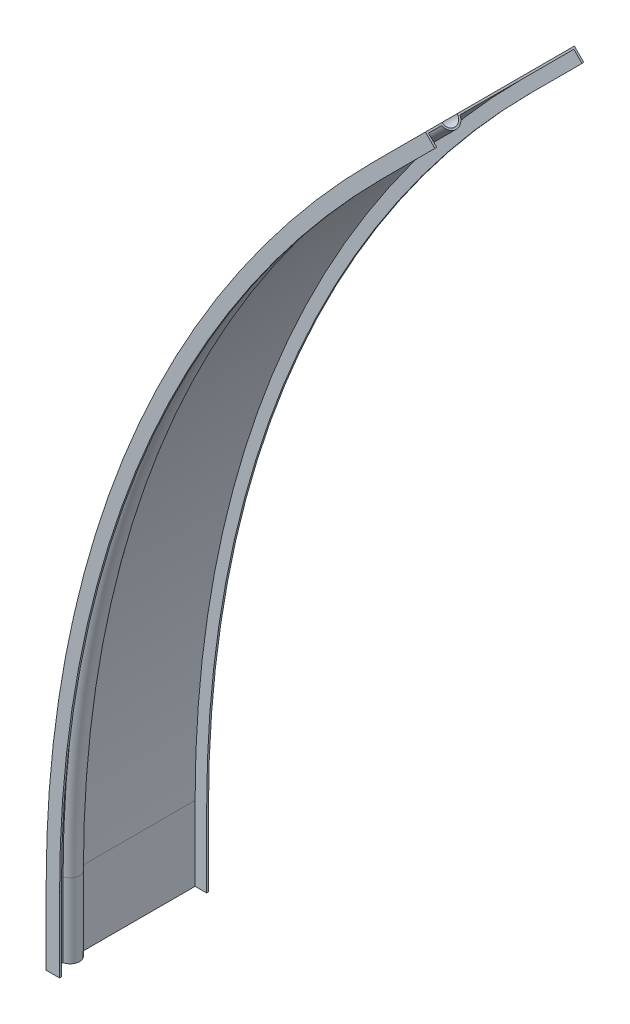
ISO-10303-21;
HEADER;
FILE_DESCRIPTION(('STEP AP214'),'2;1');
FILE_NAME('part.step','',(''),(''),'','','');
FILE_SCHEMA(('AUTOMOTIVE_DESIGN { 1 0 10303 214 1 1 1 1 }'));
ENDSEC;
DATA;
#1=APPLICATION_CONTEXT('core data for automotive mechanical design processes');
#2=APPLICATION_PROTOCOL_DEFINITION('international standard','automotive_design',2000,#1);
#3=PRODUCT_CONTEXT('',#1,'mechanical');
#4=PRODUCT('Part','Part','',(#3));
#5=PRODUCT_RELATED_PRODUCT_CATEGORY('part','',(#4));
#6=PRODUCT_DEFINITION_FORMATION('','',#4);
#7=PRODUCT_DEFINITION_CONTEXT('part definition',#1,'design');
#8=PRODUCT_DEFINITION('design','',#6,#7);
#9=PRODUCT_DEFINITION_SHAPE('','',#8);
#10=(LENGTH_UNIT() NAMED_UNIT(*) SI_UNIT(.MILLI.,.METRE.));
#11=(NAMED_UNIT(*) PLANE_ANGLE_UNIT() SI_UNIT($,.RADIAN.));
#12=(NAMED_UNIT(*) SI_UNIT($,.STERADIAN.) SOLID_ANGLE_UNIT());
#13=UNCERTAINTY_MEASURE_WITH_UNIT(LENGTH_MEASURE(1.E-05),#10,'distance_accuracy_value','');
#14=(GEOMETRIC_REPRESENTATION_CONTEXT(3) GLOBAL_UNCERTAINTY_ASSIGNED_CONTEXT((#13)) GLOBAL_UNIT_ASSIGNED_CONTEXT((#10,
#11,#12)) REPRESENTATION_CONTEXT('',''));
#15=CARTESIAN_POINT('',(0.,0.,0.));
#16=DIRECTION('',(0.,0.,1.));
#17=DIRECTION('',(1.,0.,0.));
#18=AXIS2_PLACEMENT_3D('',#15,#16,#17);
#19=CARTESIAN_POINT('',(218.100341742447,579.471658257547,82.572));
#20=DIRECTION('',(0.707106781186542,0.707106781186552,0.));
#21=DIRECTION('',(-0.707106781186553,0.707106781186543,0.));
#22=AXIS2_PLACEMENT_3D('',#19,#20,#21);
#23=CYLINDRICAL_SURFACE('',#22,5.);
#24=CARTESIAN_POINT('',(218.100341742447,579.471658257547,82.572));
#25=DIRECTION('',(-0.707106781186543,-0.707106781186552,0.));
#26=DIRECTION('',(0.,0.,-1.));
#27=AXIS2_PLACEMENT_3D('',#24,#25,#26);
#28=CIRCLE('',#27,5.);
#29=CARTESIAN_POINT('',(218.100341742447,579.471658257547,77.572));
#30=VERTEX_POINT('',#29);
#31=CARTESIAN_POINT('',(218.100341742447,579.471658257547,87.572));
#32=VERTEX_POINT('',#31);
#33=EDGE_CURVE('E200',#30,#32,#28,.T.);
#34=ORIENTED_EDGE('',*,*,#33,.T.);
#35=DIRECTION('',(0.707106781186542,0.707106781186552,0.));
#36=VECTOR('',#35,1.);
#37=CARTESIAN_POINT('',(218.100341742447,579.471658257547,87.572));
#38=LINE('',#37,#36);
#39=CARTESIAN_POINT('',(253.455680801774,614.826997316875,87.572));
#40=VERTEX_POINT('',#39);
#41=EDGE_CURVE('E37',#32,#40,#38,.T.);
#42=ORIENTED_EDGE('',*,*,#41,.T.);
#43=CARTESIAN_POINT('',(253.455680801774,614.826997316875,82.572));
#44=DIRECTION('',(-0.707106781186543,-0.707106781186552,0.));
#45=DIRECTION('',(0.,0.,-1.));
#46=AXIS2_PLACEMENT_3D('',#43,#44,#45);
#47=CIRCLE('',#46,5.);
#48=CARTESIAN_POINT('',(253.455680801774,614.826997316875,77.572));
#49=VERTEX_POINT('',#48);
#50=EDGE_CURVE('E44',#49,#40,#47,.T.);
#51=ORIENTED_EDGE('',*,*,#50,.F.);
#52=DIRECTION('',(0.707106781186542,0.707106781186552,0.));
#53=VECTOR('',#52,1.);
#54=CARTESIAN_POINT('',(218.100341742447,579.471658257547,77.572));
#55=LINE('',#54,#53);
#56=EDGE_CURVE('E11',#30,#49,#55,.T.);
#57=ORIENTED_EDGE('',*,*,#56,.F.);
#58=EDGE_LOOP('',(#34,#42,#51,#57));
#59=FACE_BOUND('',#58,.T.);
#60=ADVANCED_FACE('F30',(#59),#23,.F.);
#61=CARTESIAN_POINT('',(218.100341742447,579.471658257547,87.572));
#62=DIRECTION('',(-0.707106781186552,0.707106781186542,0.));
#63=DIRECTION('',(-0.707106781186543,-0.707106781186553,0.));
#64=AXIS2_PLACEMENT_3D('',#61,#62,#63);
#65=PLANE('',#64);
#66=DIRECTION('',(0.,0.,1.));
#67=VECTOR('',#66,1.);
#68=CARTESIAN_POINT('',(218.100341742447,579.471658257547,87.572));
#69=LINE('',#68,#67);
#70=CARTESIAN_POINT('',(218.100341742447,579.471658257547,98.786));
#71=VERTEX_POINT('',#70);
#72=EDGE_CURVE('E253',#32,#71,#69,.T.);
#73=ORIENTED_EDGE('',*,*,#72,.T.);
#74=DIRECTION('',(0.707106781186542,0.707106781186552,0.));
#75=VECTOR('',#74,1.);
#76=CARTESIAN_POINT('',(218.100341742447,579.471658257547,98.786));
#77=LINE('',#76,#75);
#78=CARTESIAN_POINT('',(253.455680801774,614.826997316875,98.786));
#79=VERTEX_POINT('',#78);
#80=EDGE_CURVE('E343',#71,#79,#77,.T.);
#81=ORIENTED_EDGE('',*,*,#80,.T.);
#82=DIRECTION('',(0.,0.,1.));
#83=VECTOR('',#82,1.);
#84=CARTESIAN_POINT('',(253.455680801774,614.826997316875,87.572));
#85=LINE('',#84,#83);
#86=EDGE_CURVE('E52',#40,#79,#85,.T.);
#87=ORIENTED_EDGE('',*,*,#86,.F.);
#88=ORIENTED_EDGE('',*,*,#41,.F.);
#89=EDGE_LOOP('',(#73,#81,#87,#88));
#90=FACE_BOUND('',#89,.T.);
#91=ADVANCED_FACE('F345',(#90),#65,.T.);
#92=CARTESIAN_POINT('',(224.464302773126,573.107697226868,97.572));
#93=DIRECTION('',(0.707106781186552,-0.707106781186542,0.));
#94=DIRECTION('',(0.707106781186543,0.707106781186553,0.));
#95=AXIS2_PLACEMENT_3D('',#92,#93,#94);
#96=PLANE('',#95);
#97=DIRECTION('',(0.,0.,-1.));
#98=VECTOR('',#97,1.);
#99=CARTESIAN_POINT('',(224.464302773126,573.107697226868,97.572));
#100=LINE('',#99,#98);
#101=CARTESIAN_POINT('',(224.464302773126,573.107697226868,98.786));
#102=VERTEX_POINT('',#101);
#103=CARTESIAN_POINT('',(224.464302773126,573.107697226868,97.572));
#104=VERTEX_POINT('',#103);
#105=EDGE_CURVE('E250',#102,#104,#100,.T.);
#106=ORIENTED_EDGE('',*,*,#105,.T.);
#107=DIRECTION('',(0.707106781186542,0.707106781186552,0.));
#108=VECTOR('',#107,1.);
#109=CARTESIAN_POINT('',(224.464302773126,573.107697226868,97.572));
#110=LINE('',#109,#108);
#111=CARTESIAN_POINT('',(259.819641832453,608.463036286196,97.572));
#112=VERTEX_POINT('',#111);
#113=EDGE_CURVE('E337',#104,#112,#110,.T.);
#114=ORIENTED_EDGE('',*,*,#113,.T.);
#115=DIRECTION('',(0.,0.,-1.));
#116=VECTOR('',#115,1.);
#117=CARTESIAN_POINT('',(259.819641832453,608.463036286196,97.572));
#118=LINE('',#117,#116);
#119=CARTESIAN_POINT('',(259.819641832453,608.463036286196,98.786));
#120=VERTEX_POINT('',#119);
#121=EDGE_CURVE('E308',#120,#112,#118,.T.);
#122=ORIENTED_EDGE('',*,*,#121,.F.);
#123=DIRECTION('',(0.707106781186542,0.707106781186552,0.));
#124=VECTOR('',#123,1.);
#125=CARTESIAN_POINT('',(224.464302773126,573.107697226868,98.786));
#126=LINE('',#125,#124);
#127=EDGE_CURVE('E340',#102,#120,#126,.T.);
#128=ORIENTED_EDGE('',*,*,#127,.F.);
#129=EDGE_LOOP('',(#106,#114,#122,#128));
#130=FACE_BOUND('',#129,.T.);
#131=ADVANCED_FACE('F471',(#130),#96,.T.);
#132=CARTESIAN_POINT('',(218.958769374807,578.613230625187,88.666259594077));
#133=DIRECTION('',(0.707106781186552,-0.707106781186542,0.));
#134=DIRECTION('',(0.707106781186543,0.707106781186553,0.));
#135=AXIS2_PLACEMENT_3D('',#132,#133,#134);
#136=PLANE('',#135);
#137=DIRECTION('',(0.,0.,-1.));
#138=VECTOR('',#137,1.);
#139=CARTESIAN_POINT('',(218.958769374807,578.613230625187,88.666259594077));
#140=LINE('',#139,#138);
#141=CARTESIAN_POINT('',(218.958769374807,578.613230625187,97.572));
#142=VERTEX_POINT('',#141);
#143=CARTESIAN_POINT('',(218.958769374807,578.613230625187,88.666259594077));
#144=VERTEX_POINT('',#143);
#145=EDGE_CURVE('E247',#142,#144,#140,.T.);
#146=ORIENTED_EDGE('',*,*,#145,.T.);
#147=DIRECTION('',(0.707106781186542,0.707106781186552,0.));
#148=VECTOR('',#147,1.);
#149=CARTESIAN_POINT('',(218.958769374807,578.613230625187,88.666259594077));
#150=LINE('',#149,#148);
#151=CARTESIAN_POINT('',(254.314108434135,613.968569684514,88.666259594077));
#152=VERTEX_POINT('',#151);
#153=EDGE_CURVE('E331',#144,#152,#150,.T.);
#154=ORIENTED_EDGE('',*,*,#153,.T.);
#155=DIRECTION('',(0.,0.,-1.));
#156=VECTOR('',#155,1.);
#157=CARTESIAN_POINT('',(254.314108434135,613.968569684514,88.666259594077));
#158=LINE('',#157,#156);
#159=CARTESIAN_POINT('',(254.314108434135,613.968569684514,97.572));
#160=VERTEX_POINT('',#159);
#161=EDGE_CURVE('E302',#160,#152,#158,.T.);
#162=ORIENTED_EDGE('',*,*,#161,.F.);
#163=DIRECTION('',(0.707106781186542,0.707106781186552,0.));
#164=VECTOR('',#163,1.);
#165=CARTESIAN_POINT('',(218.958769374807,578.613230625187,97.572));
#166=LINE('',#165,#164);
#167=EDGE_CURVE('E334',#142,#160,#166,.T.);
#168=ORIENTED_EDGE('',*,*,#167,.F.);
#169=EDGE_LOOP('',(#146,#154,#162,#168));
#170=FACE_BOUND('',#169,.T.);
#171=ADVANCED_FACE('F474',(#170),#136,.T.);
#172=CARTESIAN_POINT('',(218.100341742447,579.471658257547,82.572));
#173=DIRECTION('',(0.707106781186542,0.707106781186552,0.));
#174=DIRECTION('',(-0.707106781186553,0.707106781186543,0.));
#175=AXIS2_PLACEMENT_3D('',#172,#173,#174);
#176=CYLINDRICAL_SURFACE('',#175,6.214);
#177=CARTESIAN_POINT('',(218.100341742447,579.471658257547,82.572));
#178=DIRECTION('',(0.707106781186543,0.707106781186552,0.));
#179=DIRECTION('',(0.,0.,1.));
#180=AXIS2_PLACEMENT_3D('',#177,#178,#179);
#181=CIRCLE('',#180,6.214);
#182=CARTESIAN_POINT('',(218.958769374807,578.613230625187,76.477740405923));
#183=VERTEX_POINT('',#182);
#184=EDGE_CURVE('E244',#144,#183,#181,.T.);
#185=ORIENTED_EDGE('',*,*,#184,.T.);
#186=DIRECTION('',(0.707106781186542,0.707106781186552,0.));
#187=VECTOR('',#186,1.);
#188=CARTESIAN_POINT('',(218.958769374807,578.613230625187,76.477740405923));
#189=LINE('',#188,#187);
#190=CARTESIAN_POINT('',(254.314108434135,613.968569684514,76.477740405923));
#191=VERTEX_POINT('',#190);
#192=EDGE_CURVE('E328',#183,#191,#189,.T.);
#193=ORIENTED_EDGE('',*,*,#192,.T.);
#194=CARTESIAN_POINT('',(253.455680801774,614.826997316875,82.572));
#195=DIRECTION('',(0.707106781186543,0.707106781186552,0.));
#196=DIRECTION('',(0.,0.,1.));
#197=AXIS2_PLACEMENT_3D('',#194,#195,#196);
#198=CIRCLE('',#197,6.214);
#199=EDGE_CURVE('E299',#152,#191,#198,.T.);
#200=ORIENTED_EDGE('',*,*,#199,.F.);
#201=ORIENTED_EDGE('',*,*,#153,.F.);
#202=EDGE_LOOP('',(#185,#193,#200,#201));
#203=FACE_BOUND('',#202,.T.);
#204=ADVANCED_FACE('F481',(#203),#176,.T.);
#205=CARTESIAN_POINT('',(218.958769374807,578.613230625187,0.));
#206=DIRECTION('',(0.707106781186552,-0.707106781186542,0.));
#207=DIRECTION('',(0.707106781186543,0.707106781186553,0.));
#208=AXIS2_PLACEMENT_3D('',#205,#206,#207);
#209=PLANE('',#208);
#210=DIRECTION('',(0.,0.,-1.));
#211=VECTOR('',#210,1.);
#212=CARTESIAN_POINT('',(218.958769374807,578.613230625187,0.));
#213=LINE('',#212,#211);
#214=CARTESIAN_POINT('',(218.958769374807,578.613230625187,0.));
#215=VERTEX_POINT('',#214);
#216=EDGE_CURVE('E241',#183,#215,#213,.T.);
#217=ORIENTED_EDGE('',*,*,#216,.T.);
#218=DIRECTION('',(0.707106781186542,0.707106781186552,0.));
#219=VECTOR('',#218,1.);
#220=CARTESIAN_POINT('',(218.958769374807,578.613230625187,0.));
#221=LINE('',#220,#219);
#222=CARTESIAN_POINT('',(254.314108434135,613.968569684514,0.));
#223=VERTEX_POINT('',#222);
#224=EDGE_CURVE('E325',#215,#223,#221,.T.);
#225=ORIENTED_EDGE('',*,*,#224,.T.);
#226=DIRECTION('',(0.,0.,-1.));
#227=VECTOR('',#226,1.);
#228=CARTESIAN_POINT('',(254.314108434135,613.968569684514,0.));
#229=LINE('',#228,#227);
#230=EDGE_CURVE('E296',#191,#223,#229,.T.);
#231=ORIENTED_EDGE('',*,*,#230,.F.);
#232=ORIENTED_EDGE('',*,*,#192,.F.);
#233=EDGE_LOOP('',(#217,#225,#231,#232));
#234=FACE_BOUND('',#233,.T.);
#235=ADVANCED_FACE('F483',(#234),#209,.T.);
#236=CARTESIAN_POINT('',(224.464302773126,573.107697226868,-1.214));
#237=DIRECTION('',(0.707106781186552,-0.707106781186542,0.));
#238=DIRECTION('',(0.707106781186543,0.707106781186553,0.));
#239=AXIS2_PLACEMENT_3D('',#236,#237,#238);
#240=PLANE('',#239);
#241=DIRECTION('',(0.,0.,-1.));
#242=VECTOR('',#241,1.);
#243=CARTESIAN_POINT('',(224.464302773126,573.107697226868,-1.214));
#244=LINE('',#243,#242);
#245=CARTESIAN_POINT('',(224.464302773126,573.107697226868,0.));
#246=VERTEX_POINT('',#245);
#247=CARTESIAN_POINT('',(224.464302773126,573.107697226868,-1.214));
#248=VERTEX_POINT('',#247);
#249=EDGE_CURVE('E233',#246,#248,#244,.T.);
#250=ORIENTED_EDGE('',*,*,#249,.T.);
#251=DIRECTION('',(0.707106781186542,0.707106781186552,0.));
#252=VECTOR('',#251,1.);
#253=CARTESIAN_POINT('',(224.464302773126,573.107697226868,-1.214));
#254=LINE('',#253,#252);
#255=CARTESIAN_POINT('',(259.819641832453,608.463036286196,-1.214));
#256=VERTEX_POINT('',#255);
#257=EDGE_CURVE('E319',#248,#256,#254,.T.);
#258=ORIENTED_EDGE('',*,*,#257,.T.);
#259=DIRECTION('',(0.,0.,-1.));
#260=VECTOR('',#259,1.);
#261=CARTESIAN_POINT('',(259.819641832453,608.463036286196,-1.214));
#262=LINE('',#261,#260);
#263=CARTESIAN_POINT('',(259.819641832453,608.463036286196,0.));
#264=VERTEX_POINT('',#263);
#265=EDGE_CURVE('E290',#264,#256,#262,.T.);
#266=ORIENTED_EDGE('',*,*,#265,.F.);
#267=DIRECTION('',(0.707106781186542,0.707106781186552,0.));
#268=VECTOR('',#267,1.);
#269=CARTESIAN_POINT('',(224.464302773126,573.107697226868,0.));
#270=LINE('',#269,#268);
#271=EDGE_CURVE('E322',#246,#264,#270,.T.);
#272=ORIENTED_EDGE('',*,*,#271,.F.);
#273=EDGE_LOOP('',(#250,#258,#266,#272));
#274=FACE_BOUND('',#273,.T.);
#275=ADVANCED_FACE('F486',(#274),#240,.T.);
#276=CARTESIAN_POINT('',(218.100341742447,579.471658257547,-1.214));
#277=DIRECTION('',(-0.707106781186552,0.707106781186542,0.));
#278=DIRECTION('',(-0.707106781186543,-0.707106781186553,0.));
#279=AXIS2_PLACEMENT_3D('',#276,#277,#278);
#280=PLANE('',#279);
#281=DIRECTION('',(0.,0.,1.));
#282=VECTOR('',#281,1.);
#283=CARTESIAN_POINT('',(218.100341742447,579.471658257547,-1.214));
#284=LINE('',#283,#282);
#285=CARTESIAN_POINT('',(218.100341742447,579.471658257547,-1.214));
#286=VERTEX_POINT('',#285);
#287=EDGE_CURVE('E230',#286,#30,#284,.T.);
#288=ORIENTED_EDGE('',*,*,#287,.T.);
#289=ORIENTED_EDGE('',*,*,#56,.T.);
#290=DIRECTION('',(0.,0.,1.));
#291=VECTOR('',#290,1.);
#292=CARTESIAN_POINT('',(253.455680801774,614.826997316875,-1.214));
#293=LINE('',#292,#291);
#294=CARTESIAN_POINT('',(253.455680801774,614.826997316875,-1.214));
#295=VERTEX_POINT('',#294);
#296=EDGE_CURVE('E203',#295,#49,#293,.T.);
#297=ORIENTED_EDGE('',*,*,#296,.F.);
#298=DIRECTION('',(0.707106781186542,0.707106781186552,0.));
#299=VECTOR('',#298,1.);
#300=CARTESIAN_POINT('',(218.100341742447,579.471658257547,-1.214));
#301=LINE('',#300,#299);
#302=EDGE_CURVE('E316',#286,#295,#301,.T.);
#303=ORIENTED_EDGE('',*,*,#302,.F.);
#304=EDGE_LOOP('',(#288,#289,#297,#303));
#305=FACE_BOUND('',#304,.T.);
#306=ADVANCED_FACE('F357',(#305),#280,.T.);
#307=CARTESIAN_POINT('',(747.572000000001,49.9999999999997,82.572));
#308=DIRECTION('',(0.,0.,-1.));
#309=DIRECTION('',(-1.,0.,0.));
#310=AXIS2_PLACEMENT_3D('',#307,#308,#309);
#311=TOROIDAL_SURFACE('',#310,748.786000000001,5.);
#312=CARTESIAN_POINT('',(-1.21400000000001,50.,82.572));
#313=DIRECTION('',(0.,-1.,0.));
#314=DIRECTION('',(0.,0.,-1.));
#315=AXIS2_PLACEMENT_3D('',#312,#313,#314);
#316=CIRCLE('',#315,5.);
#317=CARTESIAN_POINT('',(-1.21399999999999,50.,77.572));
#318=VERTEX_POINT('',#317);
#319=CARTESIAN_POINT('',(-1.21400000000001,50.,87.572));
#320=VERTEX_POINT('',#319);
#321=EDGE_CURVE('E197',#318,#320,#316,.T.);
#322=ORIENTED_EDGE('',*,*,#321,.T.);
#323=CARTESIAN_POINT('',(747.572000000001,49.9999999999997,87.572));
#324=DIRECTION('',(0.,0.,-1.));
#325=DIRECTION('',(-1.,0.,0.));
#326=AXIS2_PLACEMENT_3D('',#323,#324,#325);
#327=CIRCLE('',#326,748.786000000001);
#328=EDGE_CURVE('E204',#320,#32,#327,.T.);
#329=ORIENTED_EDGE('',*,*,#328,.T.);
#330=ORIENTED_EDGE('',*,*,#33,.F.);
#331=CARTESIAN_POINT('',(747.572000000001,49.9999999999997,77.572));
#332=DIRECTION('',(0.,0.,-1.));
#333=DIRECTION('',(-1.,0.,0.));
#334=AXIS2_PLACEMENT_3D('',#331,#332,#333);
#335=CIRCLE('',#334,748.786000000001);
#336=EDGE_CURVE('E192',#318,#30,#335,.T.);
#337=ORIENTED_EDGE('',*,*,#336,.F.);
#338=EDGE_LOOP('',(#322,#329,#330,#337));
#339=FACE_BOUND('',#338,.T.);
#340=ADVANCED_FACE('F194',(#339),#311,.F.);
#341=CARTESIAN_POINT('',(747.572000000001,49.9999999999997,0.));
#342=DIRECTION('',(0.,0.,-1.));
#343=DIRECTION('',(-1.,0.,0.));
#344=AXIS2_PLACEMENT_3D('',#341,#342,#343);
#345=CYLINDRICAL_SURFACE('',#344,748.786000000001);
#346=DIRECTION('',(0.,0.,1.));
#347=VECTOR('',#346,1.);
#348=CARTESIAN_POINT('',(-1.21400000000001,50.,87.572));
#349=LINE('',#348,#347);
#350=CARTESIAN_POINT('',(-1.21399999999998,50.,98.786));
#351=VERTEX_POINT('',#350);
#352=EDGE_CURVE('E225',#320,#351,#349,.T.);
#353=ORIENTED_EDGE('',*,*,#352,.T.);
#354=CARTESIAN_POINT('',(747.572000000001,49.9999999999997,98.786));
#355=DIRECTION('',(0.,0.,-1.));
#356=DIRECTION('',(-1.,0.,0.));
#357=AXIS2_PLACEMENT_3D('',#354,#355,#356);
#358=CIRCLE('',#357,748.786000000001);
#359=EDGE_CURVE('E282',#351,#71,#358,.T.);
#360=ORIENTED_EDGE('',*,*,#359,.T.);
#361=ORIENTED_EDGE('',*,*,#72,.F.);
#362=ORIENTED_EDGE('',*,*,#328,.F.);
#363=EDGE_LOOP('',(#353,#360,#361,#362));
#364=FACE_BOUND('',#363,.T.);
#365=ADVANCED_FACE('F348',(#364),#345,.T.);
#366=CARTESIAN_POINT('',(747.572000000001,49.9999999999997,0.));
#367=DIRECTION('',(0.,0.,-1.));
#368=DIRECTION('',(-1.,0.,0.));
#369=AXIS2_PLACEMENT_3D('',#366,#367,#368);
#370=CYLINDRICAL_SURFACE('',#369,739.786000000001);
#371=DIRECTION('',(0.,0.,-1.));
#372=VECTOR('',#371,1.);
#373=CARTESIAN_POINT('',(7.78600000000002,50.,97.572));
#374=LINE('',#373,#372);
#375=CARTESIAN_POINT('',(7.78600000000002,50.,98.786));
#376=VERTEX_POINT('',#375);
#377=CARTESIAN_POINT('',(7.78600000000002,50.,97.572));
#378=VERTEX_POINT('',#377);
#379=EDGE_CURVE('E401',#376,#378,#374,.T.);
#380=ORIENTED_EDGE('',*,*,#379,.T.);
#381=CARTESIAN_POINT('',(747.572000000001,49.9999999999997,97.572));
#382=DIRECTION('',(0.,0.,-1.));
#383=DIRECTION('',(-1.,0.,0.));
#384=AXIS2_PLACEMENT_3D('',#381,#382,#383);
#385=CIRCLE('',#384,739.786000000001);
#386=EDGE_CURVE('E276',#378,#104,#385,.T.);
#387=ORIENTED_EDGE('',*,*,#386,.T.);
#388=ORIENTED_EDGE('',*,*,#105,.F.);
#389=CARTESIAN_POINT('',(747.572000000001,49.9999999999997,98.786));
#390=DIRECTION('',(0.,0.,-1.));
#391=DIRECTION('',(-1.,0.,0.));
#392=AXIS2_PLACEMENT_3D('',#389,#390,#391);
#393=CIRCLE('',#392,739.786000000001);
#394=EDGE_CURVE('E279',#376,#102,#393,.T.);
#395=ORIENTED_EDGE('',*,*,#394,.F.);
#396=EDGE_LOOP('',(#380,#387,#388,#395));
#397=FACE_BOUND('',#396,.T.);
#398=ADVANCED_FACE('F469',(#397),#370,.F.);
#399=CARTESIAN_POINT('',(747.572000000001,49.9999999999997,0.));
#400=DIRECTION('',(0.,0.,-1.));
#401=DIRECTION('',(-1.,0.,0.));
#402=AXIS2_PLACEMENT_3D('',#399,#400,#401);
#403=CYLINDRICAL_SURFACE('',#402,747.572000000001);
#404=DIRECTION('',(0.,0.,-1.));
#405=VECTOR('',#404,1.);
#406=CARTESIAN_POINT('',(0.,50.,88.666259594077));
#407=LINE('',#406,#405);
#408=CARTESIAN_POINT('',(0.,50.,97.572));
#409=VERTEX_POINT('',#408);
#410=CARTESIAN_POINT('',(0.,50.,88.666259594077));
#411=VERTEX_POINT('',#410);
#412=EDGE_CURVE('E437',#409,#411,#407,.T.);
#413=ORIENTED_EDGE('',*,*,#412,.T.);
#414=CARTESIAN_POINT('',(747.572000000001,49.9999999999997,88.666259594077));
#415=DIRECTION('',(0.,0.,-1.));
#416=DIRECTION('',(-1.,0.,0.));
#417=AXIS2_PLACEMENT_3D('',#414,#415,#416);
#418=CIRCLE('',#417,747.572000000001);
#419=EDGE_CURVE('E270',#411,#144,#418,.T.);
#420=ORIENTED_EDGE('',*,*,#419,.T.);
#421=ORIENTED_EDGE('',*,*,#145,.F.);
#422=CARTESIAN_POINT('',(747.572000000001,49.9999999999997,97.572));
#423=DIRECTION('',(0.,0.,-1.));
#424=DIRECTION('',(-1.,0.,0.));
#425=AXIS2_PLACEMENT_3D('',#422,#423,#424);
#426=CIRCLE('',#425,747.572000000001);
#427=EDGE_CURVE('E273',#409,#142,#426,.T.);
#428=ORIENTED_EDGE('',*,*,#427,.F.);
#429=EDGE_LOOP('',(#413,#420,#421,#428));
#430=FACE_BOUND('',#429,.T.);
#431=ADVANCED_FACE('F477',(#430),#403,.F.);
#432=CARTESIAN_POINT('',(747.572000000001,49.9999999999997,82.572));
#433=DIRECTION('',(0.,0.,-1.));
#434=DIRECTION('',(-1.,0.,0.));
#435=AXIS2_PLACEMENT_3D('',#432,#433,#434);
#436=TOROIDAL_SURFACE('',#435,748.786000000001,6.214);
#437=CARTESIAN_POINT('',(-1.21400000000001,50.,82.572));
#438=DIRECTION('',(0.,1.,0.));
#439=DIRECTION('',(0.,0.,1.));
#440=AXIS2_PLACEMENT_3D('',#437,#438,#439);
#441=CIRCLE('',#440,6.214);
#442=CARTESIAN_POINT('',(0.,50.,76.477740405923));
#443=VERTEX_POINT('',#442);
#444=EDGE_CURVE('E442',#411,#443,#441,.T.);
#445=ORIENTED_EDGE('',*,*,#444,.T.);
#446=CARTESIAN_POINT('',(747.572000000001,49.9999999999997,76.477740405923));
#447=DIRECTION('',(0.,0.,-1.));
#448=DIRECTION('',(-1.,0.,0.));
#449=AXIS2_PLACEMENT_3D('',#446,#447,#448);
#450=CIRCLE('',#449,747.572000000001);
#451=EDGE_CURVE('E267',#443,#183,#450,.T.);
#452=ORIENTED_EDGE('',*,*,#451,.T.);
#453=ORIENTED_EDGE('',*,*,#184,.F.);
#454=ORIENTED_EDGE('',*,*,#419,.F.);
#455=EDGE_LOOP('',(#445,#452,#453,#454));
#456=FACE_BOUND('',#455,.T.);
#457=ADVANCED_FACE('F479',(#456),#436,.T.);
#458=CARTESIAN_POINT('',(747.572000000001,49.9999999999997,0.));
#459=DIRECTION('',(0.,0.,-1.));
#460=DIRECTION('',(-1.,0.,0.));
#461=AXIS2_PLACEMENT_3D('',#458,#459,#460);
#462=CYLINDRICAL_SURFACE('',#461,747.572000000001);
#463=DIRECTION('',(0.,0.,-1.));
#464=VECTOR('',#463,1.);
#465=CARTESIAN_POINT('',(0.,50.,0.));
#466=LINE('',#465,#464);
#467=CARTESIAN_POINT('',(0.,50.,0.));
#468=VERTEX_POINT('',#467);
#469=EDGE_CURVE('E369',#443,#468,#466,.T.);
#470=ORIENTED_EDGE('',*,*,#469,.T.);
#471=CARTESIAN_POINT('',(747.572000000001,49.9999999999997,0.));
#472=DIRECTION('',(0.,0.,-1.));
#473=DIRECTION('',(-1.,0.,0.));
#474=AXIS2_PLACEMENT_3D('',#471,#472,#473);
#475=CIRCLE('',#474,747.572000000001);
#476=EDGE_CURVE('E264',#468,#215,#475,.T.);
#477=ORIENTED_EDGE('',*,*,#476,.T.);
#478=ORIENTED_EDGE('',*,*,#216,.F.);
#479=ORIENTED_EDGE('',*,*,#451,.F.);
#480=EDGE_LOOP('',(#470,#477,#478,#479));
#481=FACE_BOUND('',#480,.T.);
#482=ADVANCED_FACE('F448',(#481),#462,.F.);
#483=CARTESIAN_POINT('',(747.572000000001,49.9999999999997,0.));
#484=DIRECTION('',(0.,0.,-1.));
#485=DIRECTION('',(-1.,0.,0.));
#486=AXIS2_PLACEMENT_3D('',#483,#484,#485);
#487=CYLINDRICAL_SURFACE('',#486,739.786000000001);
#488=DIRECTION('',(0.,0.,-1.));
#489=VECTOR('',#488,1.);
#490=CARTESIAN_POINT('',(7.786,50.,-1.214));
#491=LINE('',#490,#489);
#492=CARTESIAN_POINT('',(7.786,50.,0.));
#493=VERTEX_POINT('',#492);
#494=CARTESIAN_POINT('',(7.786,50.,-1.214));
#495=VERTEX_POINT('',#494);
#496=EDGE_CURVE('E364',#493,#495,#491,.T.);
#497=ORIENTED_EDGE('',*,*,#496,.T.);
#498=CARTESIAN_POINT('',(747.572000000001,49.9999999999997,-1.214));
#499=DIRECTION('',(0.,0.,-1.));
#500=DIRECTION('',(-1.,0.,0.));
#501=AXIS2_PLACEMENT_3D('',#498,#499,#500);
#502=CIRCLE('',#501,739.786000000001);
#503=EDGE_CURVE('E258',#495,#248,#502,.T.);
#504=ORIENTED_EDGE('',*,*,#503,.T.);
#505=ORIENTED_EDGE('',*,*,#249,.F.);
#506=CARTESIAN_POINT('',(747.572000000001,49.9999999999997,0.));
#507=DIRECTION('',(0.,0.,-1.));
#508=DIRECTION('',(-1.,0.,0.));
#509=AXIS2_PLACEMENT_3D('',#506,#507,#508);
#510=CIRCLE('',#509,739.786000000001);
#511=EDGE_CURVE('E261',#493,#246,#510,.T.);
#512=ORIENTED_EDGE('',*,*,#511,.F.);
#513=EDGE_LOOP('',(#497,#504,#505,#512));
#514=FACE_BOUND('',#513,.T.);
#515=ADVANCED_FACE('F488',(#514),#487,.F.);
#516=CARTESIAN_POINT('',(747.572000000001,49.9999999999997,0.));
#517=DIRECTION('',(0.,0.,-1.));
#518=DIRECTION('',(-1.,0.,0.));
#519=AXIS2_PLACEMENT_3D('',#516,#517,#518);
#520=CYLINDRICAL_SURFACE('',#519,748.786000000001);
#521=DIRECTION('',(0.,0.,1.));
#522=VECTOR('',#521,1.);
#523=CARTESIAN_POINT('',(-1.214,50.,-1.214));
#524=LINE('',#523,#522);
#525=CARTESIAN_POINT('',(-1.214,50.,-1.214));
#526=VERTEX_POINT('',#525);
#527=EDGE_CURVE('E207',#526,#318,#524,.T.);
#528=ORIENTED_EDGE('',*,*,#527,.T.);
#529=ORIENTED_EDGE('',*,*,#336,.T.);
#530=ORIENTED_EDGE('',*,*,#287,.F.);
#531=CARTESIAN_POINT('',(747.572000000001,49.9999999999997,-1.214));
#532=DIRECTION('',(0.,0.,-1.));
#533=DIRECTION('',(-1.,0.,0.));
#534=AXIS2_PLACEMENT_3D('',#531,#532,#533);
#535=CIRCLE('',#534,748.786000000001);
#536=EDGE_CURVE('E210',#526,#286,#535,.T.);
#537=ORIENTED_EDGE('',*,*,#536,.F.);
#538=EDGE_LOOP('',(#528,#529,#530,#537));
#539=FACE_BOUND('',#538,.T.);
#540=ADVANCED_FACE('F208',(#539),#520,.T.);
#541=CARTESIAN_POINT('',(-1.214,50.,-1.214));
#542=DIRECTION('',(1.,0.,0.));
#543=DIRECTION('',(0.,0.,-1.));
#544=AXIS2_PLACEMENT_3D('',#541,#542,#543);
#545=PLANE('',#544);
#546=DIRECTION('',(0.,0.,1.));
#547=VECTOR('',#546,1.);
#548=CARTESIAN_POINT('',(-1.214,0.,-1.214));
#549=LINE('',#548,#547);
#550=CARTESIAN_POINT('',(-1.214,0.,-1.214));
#551=VERTEX_POINT('',#550);
#552=CARTESIAN_POINT('',(-1.21399999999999,0.,77.572));
#553=VERTEX_POINT('',#552);
#554=EDGE_CURVE('E229',#551,#553,#549,.T.);
#555=ORIENTED_EDGE('',*,*,#554,.T.);
#556=DIRECTION('',(0.,-1.,0.));
#557=VECTOR('',#556,1.);
#558=CARTESIAN_POINT('',(-1.21399999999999,50.,77.572));
#559=LINE('',#558,#557);
#560=EDGE_CURVE('E220',#318,#553,#559,.T.);
#561=ORIENTED_EDGE('',*,*,#560,.F.);
#562=ORIENTED_EDGE('',*,*,#527,.F.);
#563=DIRECTION('',(0.,-1.,0.));
#564=VECTOR('',#563,1.);
#565=CARTESIAN_POINT('',(-1.214,50.,-1.214));
#566=LINE('',#565,#564);
#567=EDGE_CURVE('E360',#526,#551,#566,.T.);
#568=ORIENTED_EDGE('',*,*,#567,.T.);
#569=EDGE_LOOP('',(#555,#561,#562,#568));
#570=FACE_BOUND('',#569,.T.);
#571=ADVANCED_FACE('F227',(#570),#545,.F.);
#572=CARTESIAN_POINT('',(-1.21400000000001,50.,82.572));
#573=DIRECTION('',(0.,-1.,0.));
#574=DIRECTION('',(1.,0.,0.));
#575=AXIS2_PLACEMENT_3D('',#572,#573,#574);
#576=CYLINDRICAL_SURFACE('',#575,5.);
#577=CARTESIAN_POINT('',(-1.21400000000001,0.,82.572));
#578=DIRECTION('',(0.,-1.,0.));
#579=DIRECTION('',(0.,0.,-1.));
#580=AXIS2_PLACEMENT_3D('',#577,#578,#579);
#581=CIRCLE('',#580,5.);
#582=CARTESIAN_POINT('',(-1.21400000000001,0.,87.572));
#583=VERTEX_POINT('',#582);
#584=EDGE_CURVE('E430',#553,#583,#581,.T.);
#585=ORIENTED_EDGE('',*,*,#584,.T.);
#586=DIRECTION('',(0.,-1.,0.));
#587=VECTOR('',#586,1.);
#588=CARTESIAN_POINT('',(-1.21400000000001,50.,87.572));
#589=LINE('',#588,#587);
#590=EDGE_CURVE('E223',#320,#583,#589,.T.);
#591=ORIENTED_EDGE('',*,*,#590,.F.);
#592=ORIENTED_EDGE('',*,*,#321,.F.);
#593=ORIENTED_EDGE('',*,*,#560,.T.);
#594=EDGE_LOOP('',(#585,#591,#592,#593));
#595=FACE_BOUND('',#594,.T.);
#596=ADVANCED_FACE('F219',(#595),#576,.F.);
#597=CARTESIAN_POINT('',(-1.21400000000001,50.,87.572));
#598=DIRECTION('',(1.,0.,0.));
#599=DIRECTION('',(0.,0.,-1.));
#600=AXIS2_PLACEMENT_3D('',#597,#598,#599);
#601=PLANE('',#600);
#602=DIRECTION('',(0.,0.,1.));
#603=VECTOR('',#602,1.);
#604=CARTESIAN_POINT('',(-1.21400000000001,0.,87.572));
#605=LINE('',#604,#603);
#606=CARTESIAN_POINT('',(-1.21399999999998,0.,98.786));
#607=VERTEX_POINT('',#606);
#608=EDGE_CURVE('E412',#583,#607,#605,.T.);
#609=ORIENTED_EDGE('',*,*,#608,.T.);
#610=DIRECTION('',(0.,-1.,0.));
#611=VECTOR('',#610,1.);
#612=CARTESIAN_POINT('',(-1.21399999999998,50.,98.786));
#613=LINE('',#612,#611);
#614=EDGE_CURVE('E235',#351,#607,#613,.T.);
#615=ORIENTED_EDGE('',*,*,#614,.F.);
#616=ORIENTED_EDGE('',*,*,#352,.F.);
#617=ORIENTED_EDGE('',*,*,#590,.T.);
#618=EDGE_LOOP('',(#609,#615,#616,#617));
#619=FACE_BOUND('',#618,.T.);
#620=ADVANCED_FACE('F435',(#619),#601,.F.);
#621=CARTESIAN_POINT('',(-1.21399999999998,50.,98.786));
#622=DIRECTION('',(0.,0.,-1.));
#623=DIRECTION('',(-1.,0.,0.));
#624=AXIS2_PLACEMENT_3D('',#621,#622,#623);
#625=PLANE('',#624);
#626=DIRECTION('',(1.,0.,0.));
#627=VECTOR('',#626,1.);
#628=CARTESIAN_POINT('',(-1.21399999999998,0.,98.786));
#629=LINE('',#628,#627);
#630=CARTESIAN_POINT('',(7.78600000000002,0.,98.786));
#631=VERTEX_POINT('',#630);
#632=EDGE_CURVE('E406',#607,#631,#629,.T.);
#633=ORIENTED_EDGE('',*,*,#632,.T.);
#634=DIRECTION('',(0.,-1.,0.));
#635=VECTOR('',#634,1.);
#636=CARTESIAN_POINT('',(7.78600000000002,50.,98.786));
#637=LINE('',#636,#635);
#638=EDGE_CURVE('E391',#376,#631,#637,.T.);
#639=ORIENTED_EDGE('',*,*,#638,.F.);
#640=ORIENTED_EDGE('',*,*,#394,.T.);
#641=ORIENTED_EDGE('',*,*,#127,.T.);
#642=DIRECTION('',(0.707106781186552,-0.707106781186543,0.));
#643=VECTOR('',#642,1.);
#644=CARTESIAN_POINT('',(253.455680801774,614.826997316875,98.786));
#645=LINE('',#644,#643);
#646=EDGE_CURVE('E311',#79,#120,#645,.T.);
#647=ORIENTED_EDGE('',*,*,#646,.F.);
#648=ORIENTED_EDGE('',*,*,#80,.F.);
#649=ORIENTED_EDGE('',*,*,#359,.F.);
#650=ORIENTED_EDGE('',*,*,#614,.T.);
#651=EDGE_LOOP('',(#633,#639,#640,#641,#647,#648,#649,#650));
#652=FACE_BOUND('',#651,.T.);
#653=ADVANCED_FACE('F352',(#652),#625,.F.);
#654=CARTESIAN_POINT('',(7.78600000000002,50.,97.572));
#655=DIRECTION('',(-1.,0.,0.));
#656=DIRECTION('',(0.,-1.,0.));
#657=AXIS2_PLACEMENT_3D('',#654,#655,#656);
#658=PLANE('',#657);
#659=DIRECTION('',(0.,0.,-1.));
#660=VECTOR('',#659,1.);
#661=CARTESIAN_POINT('',(7.78600000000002,0.,97.572));
#662=LINE('',#661,#660);
#663=CARTESIAN_POINT('',(7.78600000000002,0.,97.572));
#664=VERTEX_POINT('',#663);
#665=EDGE_CURVE('E399',#631,#664,#662,.T.);
#666=ORIENTED_EDGE('',*,*,#665,.T.);
#667=DIRECTION('',(0.,-1.,0.));
#668=VECTOR('',#667,1.);
#669=CARTESIAN_POINT('',(7.78600000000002,50.,97.572));
#670=LINE('',#669,#668);
#671=EDGE_CURVE('E388',#378,#664,#670,.T.);
#672=ORIENTED_EDGE('',*,*,#671,.F.);
#673=ORIENTED_EDGE('',*,*,#379,.F.);
#674=ORIENTED_EDGE('',*,*,#638,.T.);
#675=EDGE_LOOP('',(#666,#672,#673,#674));
#676=FACE_BOUND('',#675,.T.);
#677=ADVANCED_FACE('F397',(#676),#658,.F.);
#678=CARTESIAN_POINT('',(0.,50.,97.572));
#679=DIRECTION('',(0.,0.,1.));
#680=DIRECTION('',(1.,0.,0.));
#681=AXIS2_PLACEMENT_3D('',#678,#679,#680);
#682=PLANE('',#681);
#683=DIRECTION('',(-1.,0.,0.));
#684=VECTOR('',#683,1.);
#685=CARTESIAN_POINT('',(0.,0.,97.572));
#686=LINE('',#685,#684);
#687=CARTESIAN_POINT('',(0.,0.,97.572));
#688=VERTEX_POINT('',#687);
#689=EDGE_CURVE('E408',#664,#688,#686,.T.);
#690=ORIENTED_EDGE('',*,*,#689,.T.);
#691=DIRECTION('',(0.,-1.,0.));
#692=VECTOR('',#691,1.);
#693=CARTESIAN_POINT('',(0.,50.,97.572));
#694=LINE('',#693,#692);
#695=EDGE_CURVE('E385',#409,#688,#694,.T.);
#696=ORIENTED_EDGE('',*,*,#695,.F.);
#697=ORIENTED_EDGE('',*,*,#427,.T.);
#698=ORIENTED_EDGE('',*,*,#167,.T.);
#699=DIRECTION('',(-0.707106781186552,0.707106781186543,0.));
#700=VECTOR('',#699,1.);
#701=CARTESIAN_POINT('',(254.314108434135,613.968569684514,97.572));
#702=LINE('',#701,#700);
#703=EDGE_CURVE('E305',#112,#160,#702,.T.);
#704=ORIENTED_EDGE('',*,*,#703,.F.);
#705=ORIENTED_EDGE('',*,*,#113,.F.);
#706=ORIENTED_EDGE('',*,*,#386,.F.);
#707=ORIENTED_EDGE('',*,*,#671,.T.);
#708=EDGE_LOOP('',(#690,#696,#697,#698,#704,#705,#706,#707));
#709=FACE_BOUND('',#708,.T.);
#710=ADVANCED_FACE('F466',(#709),#682,.F.);
#711=CARTESIAN_POINT('',(0.,50.,88.666259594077));
#712=DIRECTION('',(-1.,0.,0.));
#713=DIRECTION('',(0.,0.,1.));
#714=AXIS2_PLACEMENT_3D('',#711,#712,#713);
#715=PLANE('',#714);
#716=DIRECTION('',(0.,0.,-1.));
#717=VECTOR('',#716,1.);
#718=CARTESIAN_POINT('',(0.,0.,88.666259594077));
#719=LINE('',#718,#717);
#720=CARTESIAN_POINT('',(0.,0.,88.666259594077));
#721=VERTEX_POINT('',#720);
#722=EDGE_CURVE('E410',#688,#721,#719,.T.);
#723=ORIENTED_EDGE('',*,*,#722,.T.);
#724=DIRECTION('',(0.,-1.,0.));
#725=VECTOR('',#724,1.);
#726=CARTESIAN_POINT('',(0.,50.,88.666259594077));
#727=LINE('',#726,#725);
#728=EDGE_CURVE('E382',#411,#721,#727,.T.);
#729=ORIENTED_EDGE('',*,*,#728,.F.);
#730=ORIENTED_EDGE('',*,*,#412,.F.);
#731=ORIENTED_EDGE('',*,*,#695,.T.);
#732=EDGE_LOOP('',(#723,#729,#730,#731));
#733=FACE_BOUND('',#732,.T.);
#734=ADVANCED_FACE('F463',(#733),#715,.F.);
#735=CARTESIAN_POINT('',(-1.21400000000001,50.,82.572));
#736=DIRECTION('',(0.,-1.,0.));
#737=DIRECTION('',(1.,0.,0.));
#738=AXIS2_PLACEMENT_3D('',#735,#736,#737);
#739=CYLINDRICAL_SURFACE('',#738,6.214);
#740=CARTESIAN_POINT('',(-1.21400000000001,0.,82.572));
#741=DIRECTION('',(0.,1.,0.));
#742=DIRECTION('',(0.,0.,1.));
#743=AXIS2_PLACEMENT_3D('',#740,#741,#742);
#744=CIRCLE('',#743,6.214);
#745=CARTESIAN_POINT('',(0.,0.,76.477740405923));
#746=VERTEX_POINT('',#745);
#747=EDGE_CURVE('E417',#721,#746,#744,.T.);
#748=ORIENTED_EDGE('',*,*,#747,.T.);
#749=DIRECTION('',(0.,-1.,0.));
#750=VECTOR('',#749,1.);
#751=CARTESIAN_POINT('',(0.,50.,76.477740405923));
#752=LINE('',#751,#750);
#753=EDGE_CURVE('E379',#443,#746,#752,.T.);
#754=ORIENTED_EDGE('',*,*,#753,.F.);
#755=ORIENTED_EDGE('',*,*,#444,.F.);
#756=ORIENTED_EDGE('',*,*,#728,.T.);
#757=EDGE_LOOP('',(#748,#754,#755,#756));
#758=FACE_BOUND('',#757,.T.);
#759=ADVANCED_FACE('F458',(#758),#739,.T.);
#760=CARTESIAN_POINT('',(0.,50.,0.));
#761=DIRECTION('',(-1.,0.,0.));
#762=DIRECTION('',(0.,0.,1.));
#763=AXIS2_PLACEMENT_3D('',#760,#761,#762);
#764=PLANE('',#763);
#765=DIRECTION('',(0.,0.,-1.));
#766=VECTOR('',#765,1.);
#767=CARTESIAN_POINT('',(0.,0.,0.));
#768=LINE('',#767,#766);
#769=CARTESIAN_POINT('',(0.,0.,0.));
#770=VERTEX_POINT('',#769);
#771=EDGE_CURVE('E419',#746,#770,#768,.T.);
#772=ORIENTED_EDGE('',*,*,#771,.T.);
#773=DIRECTION('',(0.,-1.,0.));
#774=VECTOR('',#773,1.);
#775=CARTESIAN_POINT('',(0.,50.,0.));
#776=LINE('',#775,#774);
#777=EDGE_CURVE('E376',#468,#770,#776,.T.);
#778=ORIENTED_EDGE('',*,*,#777,.F.);
#779=ORIENTED_EDGE('',*,*,#469,.F.);
#780=ORIENTED_EDGE('',*,*,#753,.T.);
#781=EDGE_LOOP('',(#772,#778,#779,#780));
#782=FACE_BOUND('',#781,.T.);
#783=ADVANCED_FACE('F451',(#782),#764,.F.);
#784=CARTESIAN_POINT('',(7.786,50.,0.));
#785=DIRECTION('',(0.,0.,-1.));
#786=DIRECTION('',(-1.,0.,0.));
#787=AXIS2_PLACEMENT_3D('',#784,#785,#786);
#788=PLANE('',#787);
#789=DIRECTION('',(1.,0.,0.));
#790=VECTOR('',#789,1.);
#791=CARTESIAN_POINT('',(7.786,0.,0.));
#792=LINE('',#791,#790);
#793=CARTESIAN_POINT('',(7.786,0.,0.));
#794=VERTEX_POINT('',#793);
#795=EDGE_CURVE('E421',#770,#794,#792,.T.);
#796=ORIENTED_EDGE('',*,*,#795,.T.);
#797=DIRECTION('',(0.,-1.,0.));
#798=VECTOR('',#797,1.);
#799=CARTESIAN_POINT('',(7.786,50.,0.));
#800=LINE('',#799,#798);
#801=EDGE_CURVE('E366',#493,#794,#800,.T.);
#802=ORIENTED_EDGE('',*,*,#801,.F.);
#803=ORIENTED_EDGE('',*,*,#511,.T.);
#804=ORIENTED_EDGE('',*,*,#271,.T.);
#805=DIRECTION('',(0.707106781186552,-0.707106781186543,0.));
#806=VECTOR('',#805,1.);
#807=CARTESIAN_POINT('',(259.819641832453,608.463036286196,0.));
#808=LINE('',#807,#806);
#809=EDGE_CURVE('E293',#223,#264,#808,.T.);
#810=ORIENTED_EDGE('',*,*,#809,.F.);
#811=ORIENTED_EDGE('',*,*,#224,.F.);
#812=ORIENTED_EDGE('',*,*,#476,.F.);
#813=ORIENTED_EDGE('',*,*,#777,.T.);
#814=EDGE_LOOP('',(#796,#802,#803,#804,#810,#811,#812,#813));
#815=FACE_BOUND('',#814,.T.);
#816=ADVANCED_FACE('F454',(#815),#788,.F.);
#817=CARTESIAN_POINT('',(7.786,50.,-1.214));
#818=DIRECTION('',(-1.,0.,0.));
#819=DIRECTION('',(0.,-1.,0.));
#820=AXIS2_PLACEMENT_3D('',#817,#818,#819);
#821=PLANE('',#820);
#822=DIRECTION('',(0.,0.,-1.));
#823=VECTOR('',#822,1.);
#824=CARTESIAN_POINT('',(7.786,0.,-1.214));
#825=LINE('',#824,#823);
#826=CARTESIAN_POINT('',(7.786,0.,-1.214));
#827=VERTEX_POINT('',#826);
#828=EDGE_CURVE('E422',#794,#827,#825,.T.);
#829=ORIENTED_EDGE('',*,*,#828,.T.);
#830=DIRECTION('',(0.,-1.,0.));
#831=VECTOR('',#830,1.);
#832=CARTESIAN_POINT('',(7.786,50.,-1.214));
#833=LINE('',#832,#831);
#834=EDGE_CURVE('E363',#495,#827,#833,.T.);
#835=ORIENTED_EDGE('',*,*,#834,.F.);
#836=ORIENTED_EDGE('',*,*,#496,.F.);
#837=ORIENTED_EDGE('',*,*,#801,.T.);
#838=EDGE_LOOP('',(#829,#835,#836,#837));
#839=FACE_BOUND('',#838,.T.);
#840=ADVANCED_FACE('F426',(#839),#821,.F.);
#841=CARTESIAN_POINT('',(-1.214,50.,-1.214));
#842=DIRECTION('',(0.,0.,1.));
#843=DIRECTION('',(1.,0.,0.));
#844=AXIS2_PLACEMENT_3D('',#841,#842,#843);
#845=PLANE('',#844);
#846=DIRECTION('',(-1.,0.,0.));
#847=VECTOR('',#846,1.);
#848=CARTESIAN_POINT('',(-1.214,0.,-1.214));
#849=LINE('',#848,#847);
#850=EDGE_CURVE('E215',#827,#551,#849,.T.);
#851=ORIENTED_EDGE('',*,*,#850,.T.);
#852=ORIENTED_EDGE('',*,*,#567,.F.);
#853=ORIENTED_EDGE('',*,*,#536,.T.);
#854=ORIENTED_EDGE('',*,*,#302,.T.);
#855=DIRECTION('',(-0.707106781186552,0.707106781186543,0.));
#856=VECTOR('',#855,1.);
#857=CARTESIAN_POINT('',(253.455680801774,614.826997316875,-1.214));
#858=LINE('',#857,#856);
#859=EDGE_CURVE('E287',#256,#295,#858,.T.);
#860=ORIENTED_EDGE('',*,*,#859,.F.);
#861=ORIENTED_EDGE('',*,*,#257,.F.);
#862=ORIENTED_EDGE('',*,*,#503,.F.);
#863=ORIENTED_EDGE('',*,*,#834,.T.);
#864=EDGE_LOOP('',(#851,#852,#853,#854,#860,#861,#862,#863));
#865=FACE_BOUND('',#864,.T.);
#866=ADVANCED_FACE('F359',(#865),#845,.F.);
#867=CARTESIAN_POINT('',(253.455680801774,614.826997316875,82.572));
#868=DIRECTION('',(-0.707106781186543,-0.707106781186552,0.));
#869=DIRECTION('',(0.,0.,-1.));
#870=AXIS2_PLACEMENT_3D('',#867,#868,#869);
#871=PLANE('',#870);
#872=ORIENTED_EDGE('',*,*,#296,.T.);
#873=ORIENTED_EDGE('',*,*,#50,.T.);
#874=ORIENTED_EDGE('',*,*,#86,.T.);
#875=ORIENTED_EDGE('',*,*,#646,.T.);
#876=ORIENTED_EDGE('',*,*,#121,.T.);
#877=ORIENTED_EDGE('',*,*,#703,.T.);
#878=ORIENTED_EDGE('',*,*,#161,.T.);
#879=ORIENTED_EDGE('',*,*,#199,.T.);
#880=ORIENTED_EDGE('',*,*,#230,.T.);
#881=ORIENTED_EDGE('',*,*,#809,.T.);
#882=ORIENTED_EDGE('',*,*,#265,.T.);
#883=ORIENTED_EDGE('',*,*,#859,.T.);
#884=EDGE_LOOP('',(#872,#873,#874,#875,#876,#877,#878,#879,#880,#881,#882,#883));
#885=FACE_BOUND('',#884,.T.);
#886=ADVANCED_FACE('F355',(#885),#871,.F.);
#887=CARTESIAN_POINT('',(-1.21400000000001,0.,82.572));
#888=DIRECTION('',(0.,-1.,0.));
#889=DIRECTION('',(0.,0.,-1.));
#890=AXIS2_PLACEMENT_3D('',#887,#888,#889);
#891=PLANE('',#890);
#892=ORIENTED_EDGE('',*,*,#554,.F.);
#893=ORIENTED_EDGE('',*,*,#850,.F.);
#894=ORIENTED_EDGE('',*,*,#828,.F.);
#895=ORIENTED_EDGE('',*,*,#795,.F.);
#896=ORIENTED_EDGE('',*,*,#771,.F.);
#897=ORIENTED_EDGE('',*,*,#747,.F.);
#898=ORIENTED_EDGE('',*,*,#722,.F.);
#899=ORIENTED_EDGE('',*,*,#689,.F.);
#900=ORIENTED_EDGE('',*,*,#665,.F.);
#901=ORIENTED_EDGE('',*,*,#632,.F.);
#902=ORIENTED_EDGE('',*,*,#608,.F.);
#903=ORIENTED_EDGE('',*,*,#584,.F.);
#904=EDGE_LOOP('',(#892,#893,#894,#895,#896,#897,#898,#899,#900,#901,#902,#903));
#905=FACE_BOUND('',#904,.T.);
#906=ADVANCED_FACE('F404',(#905),#891,.T.);
#907=CLOSED_SHELL('',(#60,#91,#131,#171,#204,#235,#275,#306,#340,#365,#398,#431,#457,#482,#515,
#540,#571,#596,#620,#653,#677,#710,#734,#759,#783,#816,#840,#866,#886,#906));
#908=MANIFOLD_SOLID_BREP('B2',#907);
#909=ADVANCED_BREP_SHAPE_REPRESENTATION('',(#18,#908),#14);
#910=SHAPE_DEFINITION_REPRESENTATION(#9,#909);
ENDSEC;
END-ISO-10303-21;
